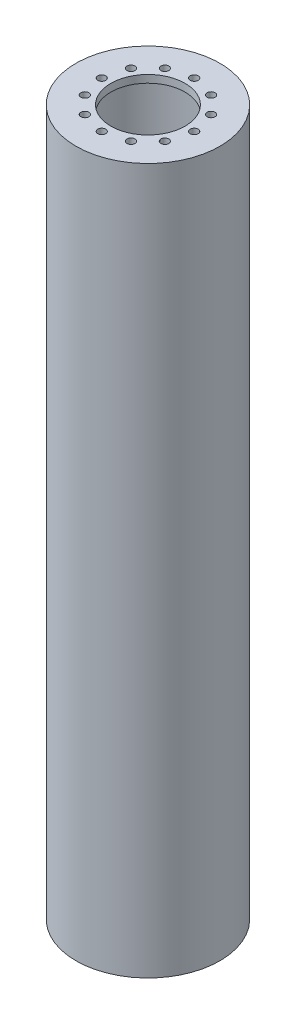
ISO-10303-21;
HEADER;
FILE_DESCRIPTION(('STEP AP214'),'2;1');
FILE_NAME('part.step','',(''),(''),'','','');
FILE_SCHEMA(('AUTOMOTIVE_DESIGN { 1 0 10303 214 1 1 1 1 }'));
ENDSEC;
DATA;
#1=APPLICATION_CONTEXT('core data for automotive mechanical design processes');
#2=APPLICATION_PROTOCOL_DEFINITION('international standard','automotive_design',2000,#1);
#3=PRODUCT_CONTEXT('',#1,'mechanical');
#4=PRODUCT('Part','Part','',(#3));
#5=PRODUCT_RELATED_PRODUCT_CATEGORY('part','',(#4));
#6=PRODUCT_DEFINITION_FORMATION('','',#4);
#7=PRODUCT_DEFINITION_CONTEXT('part definition',#1,'design');
#8=PRODUCT_DEFINITION('design','',#6,#7);
#9=PRODUCT_DEFINITION_SHAPE('','',#8);
#10=(LENGTH_UNIT() NAMED_UNIT(*) SI_UNIT(.MILLI.,.METRE.));
#11=(NAMED_UNIT(*) PLANE_ANGLE_UNIT() SI_UNIT($,.RADIAN.));
#12=(NAMED_UNIT(*) SI_UNIT($,.STERADIAN.) SOLID_ANGLE_UNIT());
#13=UNCERTAINTY_MEASURE_WITH_UNIT(LENGTH_MEASURE(1.E-05),#10,'distance_accuracy_value','');
#14=(GEOMETRIC_REPRESENTATION_CONTEXT(3) GLOBAL_UNCERTAINTY_ASSIGNED_CONTEXT((#13)) GLOBAL_UNIT_ASSIGNED_CONTEXT((#10,
#11,#12)) REPRESENTATION_CONTEXT('',''));
#15=CARTESIAN_POINT('',(0.,0.,0.));
#16=DIRECTION('',(0.,0.,1.));
#17=DIRECTION('',(1.,0.,0.));
#18=AXIS2_PLACEMENT_3D('',#15,#16,#17);
#19=CARTESIAN_POINT('',(0.,-76.1235074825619,0.));
#20=DIRECTION('',(0.,1.,0.));
#21=DIRECTION('',(0.,0.,1.));
#22=AXIS2_PLACEMENT_3D('',#19,#20,#21);
#23=PLANE('',#22);
#24=CARTESIAN_POINT('',(0.,-76.1235074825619,0.));
#25=DIRECTION('',(0.,1.,0.));
#26=DIRECTION('',(0.,0.,1.));
#27=AXIS2_PLACEMENT_3D('',#24,#25,#26);
#28=CIRCLE('',#27,95.0000000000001);
#29=CARTESIAN_POINT('',(0.,-76.1235074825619,95.0000000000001));
#30=VERTEX_POINT('',#29);
#31=EDGE_CURVE('E10',#30,#30,#28,.T.);
#32=ORIENTED_EDGE('',*,*,#31,.F.);
#33=EDGE_LOOP('',(#32));
#34=FACE_BOUND('',#33,.T.);
#35=ADVANCED_FACE('F32',(#34),#23,.F.);
#36=CARTESIAN_POINT('',(0.,1016.28551408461,0.));
#37=DIRECTION('',(0.,1.,0.));
#38=DIRECTION('',(0.,0.,1.));
#39=AXIS2_PLACEMENT_3D('',#36,#37,#38);
#40=CYLINDRICAL_SURFACE('',#39,95.0000000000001);
#41=CARTESIAN_POINT('',(0.,855.076492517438,0.));
#42=DIRECTION('',(0.,1.,0.));
#43=DIRECTION('',(0.,0.,1.));
#44=AXIS2_PLACEMENT_3D('',#41,#42,#43);
#45=CIRCLE('',#44,95.0000000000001);
#46=CARTESIAN_POINT('',(0.,855.076492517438,95.0000000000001));
#47=VERTEX_POINT('',#46);
#48=EDGE_CURVE('E38',#47,#47,#45,.T.);
#49=ORIENTED_EDGE('',*,*,#48,.F.);
#50=EDGE_LOOP('',(#49));
#51=FACE_BOUND('',#50,.T.);
#52=ORIENTED_EDGE('',*,*,#31,.T.);
#53=EDGE_LOOP('',(#52));
#54=FACE_BOUND('',#53,.T.);
#55=ADVANCED_FACE('F136',(#51,#54),#40,.T.);
#56=CARTESIAN_POINT('',(49.,855.076492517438,0.));
#57=DIRECTION('',(0.,-1.,0.));
#58=DIRECTION('',(0.,0.,-1.));
#59=AXIS2_PLACEMENT_3D('',#56,#57,#58);
#60=PLANE('',#59);
#61=CARTESIAN_POINT('',(30.4999999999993,855.076492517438,-52.8275496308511));
#62=DIRECTION('',(0.,1.,0.));
#63=DIRECTION('',(-0.499999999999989,0.,0.866025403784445));
#64=AXIS2_PLACEMENT_3D('',#61,#62,#63);
#65=CIRCLE('',#64,5.25);
#66=CARTESIAN_POINT('',(27.8749999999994,855.076492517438,-48.2809162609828));
#67=VERTEX_POINT('',#66);
#68=EDGE_CURVE('E126',#67,#67,#65,.T.);
#69=ORIENTED_EDGE('',*,*,#68,.F.);
#70=EDGE_LOOP('',(#69));
#71=FACE_BOUND('',#70,.T.);
#72=CARTESIAN_POINT('',(52.8275496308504,855.076492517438,-30.5000000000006));
#73=DIRECTION('',(0.,1.,0.));
#74=DIRECTION('',(-0.866025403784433,0.,0.50000000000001));
#75=AXIS2_PLACEMENT_3D('',#72,#73,#74);
#76=CIRCLE('',#75,5.25);
#77=CARTESIAN_POINT('',(48.2809162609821,855.076492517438,-27.8750000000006));
#78=VERTEX_POINT('',#77);
#79=EDGE_CURVE('E120',#78,#78,#76,.T.);
#80=ORIENTED_EDGE('',*,*,#79,.F.);
#81=EDGE_LOOP('',(#80));
#82=FACE_BOUND('',#81,.T.);
#83=CARTESIAN_POINT('',(61.,855.076492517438,-6.38941085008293E-13));
#84=DIRECTION('',(0.,1.,0.));
#85=DIRECTION('',(-1.,0.,0.));
#86=AXIS2_PLACEMENT_3D('',#83,#84,#85);
#87=CIRCLE('',#86,5.25);
#88=CARTESIAN_POINT('',(55.75,855.076492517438,-5.83950253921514E-13));
#89=VERTEX_POINT('',#88);
#90=EDGE_CURVE('E114',#89,#89,#87,.T.);
#91=ORIENTED_EDGE('',*,*,#90,.F.);
#92=EDGE_LOOP('',(#91));
#93=FACE_BOUND('',#92,.T.);
#94=CARTESIAN_POINT('',(52.827549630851,855.076492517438,30.4999999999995));
#95=DIRECTION('',(0.,1.,0.));
#96=DIRECTION('',(-0.866025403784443,0.,-0.499999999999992));
#97=AXIS2_PLACEMENT_3D('',#94,#95,#96);
#98=CIRCLE('',#97,5.25);
#99=CARTESIAN_POINT('',(48.2809162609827,855.076492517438,27.8749999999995));
#100=VERTEX_POINT('',#99);
#101=EDGE_CURVE('E108',#100,#100,#98,.T.);
#102=ORIENTED_EDGE('',*,*,#101,.F.);
#103=EDGE_LOOP('',(#102));
#104=FACE_BOUND('',#103,.T.);
#105=CARTESIAN_POINT('',(30.5000000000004,855.076492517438,52.8275496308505));
#106=DIRECTION('',(0.,1.,0.));
#107=DIRECTION('',(-0.500000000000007,0.,-0.866025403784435));
#108=AXIS2_PLACEMENT_3D('',#105,#106,#107);
#109=CIRCLE('',#108,5.25);
#110=CARTESIAN_POINT('',(27.8750000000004,855.076492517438,48.2809162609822));
#111=VERTEX_POINT('',#110);
#112=EDGE_CURVE('E102',#111,#111,#109,.T.);
#113=ORIENTED_EDGE('',*,*,#112,.F.);
#114=EDGE_LOOP('',(#113));
#115=FACE_BOUND('',#114,.T.);
#116=CARTESIAN_POINT('',(0.,855.076492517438,61.));
#117=DIRECTION('',(0.,1.,0.));
#118=DIRECTION('',(0.,0.,-1.));
#119=AXIS2_PLACEMENT_3D('',#116,#117,#118);
#120=CIRCLE('',#119,5.25);
#121=CARTESIAN_POINT('',(0.,855.076492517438,55.75));
#122=VERTEX_POINT('',#121);
#123=EDGE_CURVE('E96',#122,#122,#120,.T.);
#124=ORIENTED_EDGE('',*,*,#123,.F.);
#125=EDGE_LOOP('',(#124));
#126=FACE_BOUND('',#125,.T.);
#127=CARTESIAN_POINT('',(-30.4999999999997,855.076492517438,52.8275496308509));
#128=DIRECTION('',(0.,1.,0.));
#129=DIRECTION('',(0.499999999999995,0.,-0.866025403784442));
#130=AXIS2_PLACEMENT_3D('',#127,#128,#129);
#131=CIRCLE('',#130,5.25);
#132=CARTESIAN_POINT('',(-27.8749999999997,855.076492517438,48.2809162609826));
#133=VERTEX_POINT('',#132);
#134=EDGE_CURVE('E90',#133,#133,#131,.T.);
#135=ORIENTED_EDGE('',*,*,#134,.F.);
#136=EDGE_LOOP('',(#135));
#137=FACE_BOUND('',#136,.T.);
#138=CARTESIAN_POINT('',(-52.8275496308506,855.076492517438,30.5000000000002));
#139=DIRECTION('',(0.,1.,0.));
#140=DIRECTION('',(0.866025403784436,0.,-0.500000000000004));
#141=AXIS2_PLACEMENT_3D('',#138,#139,#140);
#142=CIRCLE('',#141,5.25);
#143=CARTESIAN_POINT('',(-52.8275496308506,855.076492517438,35.7500000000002));
#144=VERTEX_POINT('',#143);
#145=EDGE_CURVE('E84',#144,#144,#142,.T.);
#146=ORIENTED_EDGE('',*,*,#145,.F.);
#147=EDGE_LOOP('',(#146));
#148=FACE_BOUND('',#147,.T.);
#149=CARTESIAN_POINT('',(-61.,855.076492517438,2.12980361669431E-13));
#150=DIRECTION('',(0.,1.,0.));
#151=DIRECTION('',(1.,0.,0.));
#152=AXIS2_PLACEMENT_3D('',#149,#150,#151);
#153=CIRCLE('',#152,5.25);
#154=CARTESIAN_POINT('',(-55.75,855.076492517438,1.94650084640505E-13));
#155=VERTEX_POINT('',#154);
#156=EDGE_CURVE('E78',#155,#155,#153,.T.);
#157=ORIENTED_EDGE('',*,*,#156,.F.);
#158=EDGE_LOOP('',(#157));
#159=FACE_BOUND('',#158,.T.);
#160=CARTESIAN_POINT('',(-52.8275496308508,855.076492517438,-30.4999999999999));
#161=DIRECTION('',(0.,1.,0.));
#162=DIRECTION('',(0.86602540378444,0.,0.499999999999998));
#163=AXIS2_PLACEMENT_3D('',#160,#161,#162);
#164=CIRCLE('',#163,5.25);
#165=CARTESIAN_POINT('',(-48.2809162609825,855.076492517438,-27.8749999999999));
#166=VERTEX_POINT('',#165);
#167=EDGE_CURVE('E72',#166,#166,#164,.T.);
#168=ORIENTED_EDGE('',*,*,#167,.F.);
#169=EDGE_LOOP('',(#168));
#170=FACE_BOUND('',#169,.T.);
#171=CARTESIAN_POINT('',(-30.5000000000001,855.076492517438,-52.8275496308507));
#172=DIRECTION('',(0.,1.,0.));
#173=DIRECTION('',(0.500000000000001,0.,0.866025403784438));
#174=AXIS2_PLACEMENT_3D('',#171,#172,#173);
#175=CIRCLE('',#174,5.25);
#176=CARTESIAN_POINT('',(-27.8750000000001,855.076492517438,-48.2809162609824));
#177=VERTEX_POINT('',#176);
#178=EDGE_CURVE('E66',#177,#177,#175,.T.);
#179=ORIENTED_EDGE('',*,*,#178,.F.);
#180=EDGE_LOOP('',(#179));
#181=FACE_BOUND('',#180,.T.);
#182=CARTESIAN_POINT('',(0.,855.076492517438,-61.));
#183=DIRECTION('',(0.,1.,0.));
#184=DIRECTION('',(0.,0.,1.));
#185=AXIS2_PLACEMENT_3D('',#182,#183,#184);
#186=CIRCLE('',#185,5.25);
#187=CARTESIAN_POINT('',(0.,855.076492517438,-55.75));
#188=VERTEX_POINT('',#187);
#189=EDGE_CURVE('E60',#188,#188,#186,.T.);
#190=ORIENTED_EDGE('',*,*,#189,.F.);
#191=EDGE_LOOP('',(#190));
#192=FACE_BOUND('',#191,.T.);
#193=CARTESIAN_POINT('',(0.,855.076492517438,0.));
#194=DIRECTION('',(0.,1.,0.));
#195=DIRECTION('',(0.,0.,1.));
#196=AXIS2_PLACEMENT_3D('',#193,#194,#195);
#197=CIRCLE('',#196,49.);
#198=CARTESIAN_POINT('',(0.,855.076492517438,49.));
#199=VERTEX_POINT('',#198);
#200=EDGE_CURVE('E42',#199,#199,#197,.T.);
#201=ORIENTED_EDGE('',*,*,#200,.F.);
#202=EDGE_LOOP('',(#201));
#203=FACE_BOUND('',#202,.T.);
#204=ORIENTED_EDGE('',*,*,#48,.T.);
#205=EDGE_LOOP('',(#204));
#206=FACE_BOUND('',#205,.T.);
#207=ADVANCED_FACE('F132',(#71,#82,#93,#104,#115,#126,#137,#148,#159,#170,#181,#192,#203,#206),
#60,.F.);
#208=CARTESIAN_POINT('',(0.,1016.28551408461,0.));
#209=DIRECTION('',(0.,1.,0.));
#210=DIRECTION('',(0.,0.,1.));
#211=AXIS2_PLACEMENT_3D('',#208,#209,#210);
#212=CYLINDRICAL_SURFACE('',#211,49.);
#213=CARTESIAN_POINT('',(0.,845.076492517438,0.));
#214=DIRECTION('',(0.,1.,0.));
#215=DIRECTION('',(0.,0.,1.));
#216=AXIS2_PLACEMENT_3D('',#213,#214,#215);
#217=CIRCLE('',#216,49.);
#218=CARTESIAN_POINT('',(0.,845.076492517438,49.));
#219=VERTEX_POINT('',#218);
#220=EDGE_CURVE('E46',#219,#219,#217,.T.);
#221=ORIENTED_EDGE('',*,*,#220,.F.);
#222=EDGE_LOOP('',(#221));
#223=FACE_BOUND('',#222,.T.);
#224=ORIENTED_EDGE('',*,*,#200,.T.);
#225=EDGE_LOOP('',(#224));
#226=FACE_BOUND('',#225,.T.);
#227=ADVANCED_FACE('F135',(#223,#226),#212,.F.);
#228=CARTESIAN_POINT('',(85.0000000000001,845.076492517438,0.));
#229=DIRECTION('',(0.,1.,0.));
#230=DIRECTION('',(0.,0.,1.));
#231=AXIS2_PLACEMENT_3D('',#228,#229,#230);
#232=PLANE('',#231);
#233=CARTESIAN_POINT('',(30.4999999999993,845.076492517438,-52.8275496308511));
#234=DIRECTION('',(0.,1.,0.));
#235=DIRECTION('',(0.,0.,1.));
#236=AXIS2_PLACEMENT_3D('',#233,#234,#235);
#237=CIRCLE('',#236,5.25);
#238=CARTESIAN_POINT('',(30.4999999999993,845.076492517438,-47.5775496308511));
#239=VERTEX_POINT('',#238);
#240=EDGE_CURVE('E123',#239,#239,#237,.F.);
#241=ORIENTED_EDGE('',*,*,#240,.F.);
#242=EDGE_LOOP('',(#241));
#243=FACE_BOUND('',#242,.T.);
#244=CARTESIAN_POINT('',(52.8275496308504,845.076492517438,-30.5000000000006));
#245=DIRECTION('',(0.,1.,0.));
#246=DIRECTION('',(0.,0.,1.));
#247=AXIS2_PLACEMENT_3D('',#244,#245,#246);
#248=CIRCLE('',#247,5.25);
#249=CARTESIAN_POINT('',(52.8275496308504,845.076492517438,-25.2500000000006));
#250=VERTEX_POINT('',#249);
#251=EDGE_CURVE('E117',#250,#250,#248,.F.);
#252=ORIENTED_EDGE('',*,*,#251,.F.);
#253=EDGE_LOOP('',(#252));
#254=FACE_BOUND('',#253,.T.);
#255=CARTESIAN_POINT('',(61.,845.076492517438,-6.38941085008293E-13));
#256=DIRECTION('',(0.,1.,0.));
#257=DIRECTION('',(0.,0.,1.));
#258=AXIS2_PLACEMENT_3D('',#255,#256,#257);
#259=CIRCLE('',#258,5.25);
#260=CARTESIAN_POINT('',(61.,845.076492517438,5.24999999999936));
#261=VERTEX_POINT('',#260);
#262=EDGE_CURVE('E111',#261,#261,#259,.F.);
#263=ORIENTED_EDGE('',*,*,#262,.F.);
#264=EDGE_LOOP('',(#263));
#265=FACE_BOUND('',#264,.T.);
#266=CARTESIAN_POINT('',(52.827549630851,845.076492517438,30.4999999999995));
#267=DIRECTION('',(0.,1.,0.));
#268=DIRECTION('',(0.,0.,1.));
#269=AXIS2_PLACEMENT_3D('',#266,#267,#268);
#270=CIRCLE('',#269,5.25);
#271=CARTESIAN_POINT('',(52.827549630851,845.076492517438,35.7499999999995));
#272=VERTEX_POINT('',#271);
#273=EDGE_CURVE('E105',#272,#272,#270,.F.);
#274=ORIENTED_EDGE('',*,*,#273,.F.);
#275=EDGE_LOOP('',(#274));
#276=FACE_BOUND('',#275,.T.);
#277=CARTESIAN_POINT('',(30.5000000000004,845.076492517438,52.8275496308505));
#278=DIRECTION('',(0.,1.,0.));
#279=DIRECTION('',(0.,0.,1.));
#280=AXIS2_PLACEMENT_3D('',#277,#278,#279);
#281=CIRCLE('',#280,5.25);
#282=CARTESIAN_POINT('',(30.5000000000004,845.076492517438,58.0775496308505));
#283=VERTEX_POINT('',#282);
#284=EDGE_CURVE('E99',#283,#283,#281,.F.);
#285=ORIENTED_EDGE('',*,*,#284,.F.);
#286=EDGE_LOOP('',(#285));
#287=FACE_BOUND('',#286,.T.);
#288=CARTESIAN_POINT('',(0.,845.076492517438,61.));
#289=DIRECTION('',(0.,1.,0.));
#290=DIRECTION('',(0.,0.,1.));
#291=AXIS2_PLACEMENT_3D('',#288,#289,#290);
#292=CIRCLE('',#291,5.25);
#293=CARTESIAN_POINT('',(0.,845.076492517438,66.25));
#294=VERTEX_POINT('',#293);
#295=EDGE_CURVE('E93',#294,#294,#292,.F.);
#296=ORIENTED_EDGE('',*,*,#295,.F.);
#297=EDGE_LOOP('',(#296));
#298=FACE_BOUND('',#297,.T.);
#299=CARTESIAN_POINT('',(-30.4999999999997,845.076492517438,52.8275496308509));
#300=DIRECTION('',(0.,1.,0.));
#301=DIRECTION('',(0.,0.,1.));
#302=AXIS2_PLACEMENT_3D('',#299,#300,#301);
#303=CIRCLE('',#302,5.25);
#304=CARTESIAN_POINT('',(-30.4999999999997,845.076492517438,58.0775496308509));
#305=VERTEX_POINT('',#304);
#306=EDGE_CURVE('E87',#305,#305,#303,.F.);
#307=ORIENTED_EDGE('',*,*,#306,.F.);
#308=EDGE_LOOP('',(#307));
#309=FACE_BOUND('',#308,.T.);
#310=CARTESIAN_POINT('',(-52.8275496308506,845.076492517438,30.5000000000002));
#311=DIRECTION('',(0.,1.,0.));
#312=DIRECTION('',(0.,0.,1.));
#313=AXIS2_PLACEMENT_3D('',#310,#311,#312);
#314=CIRCLE('',#313,5.25);
#315=CARTESIAN_POINT('',(-52.8275496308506,845.076492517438,35.7500000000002));
#316=VERTEX_POINT('',#315);
#317=EDGE_CURVE('E81',#316,#316,#314,.F.);
#318=ORIENTED_EDGE('',*,*,#317,.F.);
#319=EDGE_LOOP('',(#318));
#320=FACE_BOUND('',#319,.T.);
#321=CARTESIAN_POINT('',(-61.,845.076492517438,2.12980361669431E-13));
#322=DIRECTION('',(0.,1.,0.));
#323=DIRECTION('',(0.,0.,1.));
#324=AXIS2_PLACEMENT_3D('',#321,#322,#323);
#325=CIRCLE('',#324,5.25);
#326=CARTESIAN_POINT('',(-61.,845.076492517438,5.25000000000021));
#327=VERTEX_POINT('',#326);
#328=EDGE_CURVE('E75',#327,#327,#325,.F.);
#329=ORIENTED_EDGE('',*,*,#328,.F.);
#330=EDGE_LOOP('',(#329));
#331=FACE_BOUND('',#330,.T.);
#332=CARTESIAN_POINT('',(-52.8275496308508,845.076492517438,-30.4999999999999));
#333=DIRECTION('',(0.,1.,0.));
#334=DIRECTION('',(0.,0.,1.));
#335=AXIS2_PLACEMENT_3D('',#332,#333,#334);
#336=CIRCLE('',#335,5.25);
#337=CARTESIAN_POINT('',(-52.8275496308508,845.076492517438,-25.2499999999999));
#338=VERTEX_POINT('',#337);
#339=EDGE_CURVE('E69',#338,#338,#336,.F.);
#340=ORIENTED_EDGE('',*,*,#339,.F.);
#341=EDGE_LOOP('',(#340));
#342=FACE_BOUND('',#341,.T.);
#343=CARTESIAN_POINT('',(-30.5000000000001,845.076492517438,-52.8275496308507));
#344=DIRECTION('',(0.,1.,0.));
#345=DIRECTION('',(0.,0.,1.));
#346=AXIS2_PLACEMENT_3D('',#343,#344,#345);
#347=CIRCLE('',#346,5.25);
#348=CARTESIAN_POINT('',(-30.5000000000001,845.076492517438,-47.5775496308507));
#349=VERTEX_POINT('',#348);
#350=EDGE_CURVE('E63',#349,#349,#347,.F.);
#351=ORIENTED_EDGE('',*,*,#350,.F.);
#352=EDGE_LOOP('',(#351));
#353=FACE_BOUND('',#352,.T.);
#354=CARTESIAN_POINT('',(0.,845.076492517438,-61.));
#355=DIRECTION('',(0.,1.,0.));
#356=DIRECTION('',(0.,0.,1.));
#357=AXIS2_PLACEMENT_3D('',#354,#355,#356);
#358=CIRCLE('',#357,5.25);
#359=CARTESIAN_POINT('',(0.,845.076492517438,-55.75));
#360=VERTEX_POINT('',#359);
#361=EDGE_CURVE('E57',#360,#360,#358,.F.);
#362=ORIENTED_EDGE('',*,*,#361,.F.);
#363=EDGE_LOOP('',(#362));
#364=FACE_BOUND('',#363,.T.);
#365=CARTESIAN_POINT('',(0.,845.076492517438,0.));
#366=DIRECTION('',(0.,1.,0.));
#367=DIRECTION('',(0.,0.,1.));
#368=AXIS2_PLACEMENT_3D('',#365,#366,#367);
#369=CIRCLE('',#368,85.0000000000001);
#370=CARTESIAN_POINT('',(0.,845.076492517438,85.0000000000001));
#371=VERTEX_POINT('',#370);
#372=EDGE_CURVE('E51',#371,#371,#369,.T.);
#373=ORIENTED_EDGE('',*,*,#372,.F.);
#374=EDGE_LOOP('',(#373));
#375=FACE_BOUND('',#374,.T.);
#376=ORIENTED_EDGE('',*,*,#220,.T.);
#377=EDGE_LOOP('',(#376));
#378=FACE_BOUND('',#377,.T.);
#379=ADVANCED_FACE('F163',(#243,#254,#265,#276,#287,#298,#309,#320,#331,#342,#353,#364,#375,
#378),#232,.F.);
#380=CARTESIAN_POINT('',(0.,1016.28551408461,0.));
#381=DIRECTION('',(0.,1.,0.));
#382=DIRECTION('',(0.,0.,1.));
#383=AXIS2_PLACEMENT_3D('',#380,#381,#382);
#384=CYLINDRICAL_SURFACE('',#383,85.0000000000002);
#385=CARTESIAN_POINT('',(0.,-66.1235074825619,0.));
#386=DIRECTION('',(0.,1.,0.));
#387=DIRECTION('',(0.,0.,1.));
#388=AXIS2_PLACEMENT_3D('',#385,#386,#387);
#389=CIRCLE('',#388,85.0000000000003);
#390=CARTESIAN_POINT('',(0.,-66.1235074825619,85.0000000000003));
#391=VERTEX_POINT('',#390);
#392=EDGE_CURVE('E54',#391,#391,#389,.T.);
#393=ORIENTED_EDGE('',*,*,#392,.F.);
#394=EDGE_LOOP('',(#393));
#395=FACE_BOUND('',#394,.T.);
#396=ORIENTED_EDGE('',*,*,#372,.T.);
#397=EDGE_LOOP('',(#396));
#398=FACE_BOUND('',#397,.T.);
#399=ADVANCED_FACE('F169',(#395,#398),#384,.F.);
#400=CARTESIAN_POINT('',(85.0000000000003,-66.1235074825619,0.));
#401=DIRECTION('',(0.,-1.,0.));
#402=DIRECTION('',(0.,0.,-1.));
#403=AXIS2_PLACEMENT_3D('',#400,#401,#402);
#404=PLANE('',#403);
#405=ORIENTED_EDGE('',*,*,#392,.T.);
#406=EDGE_LOOP('',(#405));
#407=FACE_BOUND('',#406,.T.);
#408=ADVANCED_FACE('F315',(#407),#404,.F.);
#409=CARTESIAN_POINT('',(0.,830.227250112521,-61.));
#410=DIRECTION('',(0.,1.,0.));
#411=DIRECTION('',(0.,0.,1.));
#412=AXIS2_PLACEMENT_3D('',#409,#410,#411);
#413=CYLINDRICAL_SURFACE('',#412,5.25);
#414=ORIENTED_EDGE('',*,*,#361,.T.);
#415=EDGE_LOOP('',(#414));
#416=FACE_BOUND('',#415,.T.);
#417=ORIENTED_EDGE('',*,*,#189,.T.);
#418=EDGE_LOOP('',(#417));
#419=FACE_BOUND('',#418,.T.);
#420=ADVANCED_FACE('F192',(#416,#419),#413,.F.);
#421=CARTESIAN_POINT('',(-30.5000000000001,830.227250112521,-52.8275496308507));
#422=DIRECTION('',(0.,1.,0.));
#423=DIRECTION('',(0.,0.,1.));
#424=AXIS2_PLACEMENT_3D('',#421,#422,#423);
#425=CYLINDRICAL_SURFACE('',#424,5.25);
#426=ORIENTED_EDGE('',*,*,#350,.T.);
#427=EDGE_LOOP('',(#426));
#428=FACE_BOUND('',#427,.T.);
#429=ORIENTED_EDGE('',*,*,#178,.T.);
#430=EDGE_LOOP('',(#429));
#431=FACE_BOUND('',#430,.T.);
#432=ADVANCED_FACE('F205',(#428,#431),#425,.F.);
#433=CARTESIAN_POINT('',(-52.8275496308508,830.227250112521,-30.4999999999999));
#434=DIRECTION('',(0.,1.,0.));
#435=DIRECTION('',(0.,0.,1.));
#436=AXIS2_PLACEMENT_3D('',#433,#434,#435);
#437=CYLINDRICAL_SURFACE('',#436,5.25);
#438=ORIENTED_EDGE('',*,*,#339,.T.);
#439=EDGE_LOOP('',(#438));
#440=FACE_BOUND('',#439,.T.);
#441=ORIENTED_EDGE('',*,*,#167,.T.);
#442=EDGE_LOOP('',(#441));
#443=FACE_BOUND('',#442,.T.);
#444=ADVANCED_FACE('F210',(#440,#443),#437,.F.);
#445=CARTESIAN_POINT('',(-61.,830.227250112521,2.12980361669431E-13));
#446=DIRECTION('',(0.,1.,0.));
#447=DIRECTION('',(0.,0.,1.));
#448=AXIS2_PLACEMENT_3D('',#445,#446,#447);
#449=CYLINDRICAL_SURFACE('',#448,5.25);
#450=ORIENTED_EDGE('',*,*,#328,.T.);
#451=EDGE_LOOP('',(#450));
#452=FACE_BOUND('',#451,.T.);
#453=ORIENTED_EDGE('',*,*,#156,.T.);
#454=EDGE_LOOP('',(#453));
#455=FACE_BOUND('',#454,.T.);
#456=ADVANCED_FACE('F220',(#452,#455),#449,.F.);
#457=CARTESIAN_POINT('',(-52.8275496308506,830.227250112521,30.5000000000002));
#458=DIRECTION('',(0.,1.,0.));
#459=DIRECTION('',(0.,0.,1.));
#460=AXIS2_PLACEMENT_3D('',#457,#458,#459);
#461=CYLINDRICAL_SURFACE('',#460,5.25);
#462=CARTESIAN_POINT('',(-52.8275496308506,845.076492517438,35.7500000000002));
#463=CARTESIAN_POINT('',(-52.8275496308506,845.180659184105,35.7500000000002));
#464=CARTESIAN_POINT('',(-52.8275496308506,845.284825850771,35.7500000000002));
#465=CARTESIAN_POINT('',(-52.8275496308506,845.493159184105,35.7500000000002));
#466=CARTESIAN_POINT('',(-52.8275496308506,845.597325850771,35.7500000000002));
#467=CARTESIAN_POINT('',(-52.8275496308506,845.805659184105,35.7500000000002));
#468=CARTESIAN_POINT('',(-52.8275496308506,845.909825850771,35.7500000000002));
#469=CARTESIAN_POINT('',(-52.8275496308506,846.118159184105,35.7500000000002));
#470=CARTESIAN_POINT('',(-52.8275496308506,846.222325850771,35.7500000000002));
#471=CARTESIAN_POINT('',(-52.8275496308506,846.430659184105,35.7500000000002));
#472=CARTESIAN_POINT('',(-52.8275496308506,846.534825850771,35.7500000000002));
#473=CARTESIAN_POINT('',(-52.8275496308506,846.743159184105,35.7500000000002));
#474=CARTESIAN_POINT('',(-52.8275496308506,846.847325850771,35.7500000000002));
#475=CARTESIAN_POINT('',(-52.8275496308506,847.055659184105,35.7500000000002));
#476=CARTESIAN_POINT('',(-52.8275496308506,847.159825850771,35.7500000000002));
#477=CARTESIAN_POINT('',(-52.8275496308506,847.368159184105,35.7500000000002));
#478=CARTESIAN_POINT('',(-52.8275496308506,847.472325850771,35.7500000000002));
#479=CARTESIAN_POINT('',(-52.8275496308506,847.680659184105,35.7500000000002));
#480=CARTESIAN_POINT('',(-52.8275496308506,847.784825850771,35.7500000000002));
#481=CARTESIAN_POINT('',(-52.8275496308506,847.993159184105,35.7500000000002));
#482=CARTESIAN_POINT('',(-52.8275496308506,848.097325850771,35.7500000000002));
#483=CARTESIAN_POINT('',(-52.8275496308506,848.305659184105,35.7500000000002));
#484=CARTESIAN_POINT('',(-52.8275496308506,848.409825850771,35.7500000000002));
#485=CARTESIAN_POINT('',(-52.8275496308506,848.618159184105,35.7500000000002));
#486=CARTESIAN_POINT('',(-52.8275496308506,848.722325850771,35.7500000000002));
#487=CARTESIAN_POINT('',(-52.8275496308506,848.930659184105,35.7500000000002));
#488=CARTESIAN_POINT('',(-52.8275496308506,849.034825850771,35.7500000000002));
#489=CARTESIAN_POINT('',(-52.8275496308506,849.243159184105,35.7500000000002));
#490=CARTESIAN_POINT('',(-52.8275496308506,849.347325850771,35.7500000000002));
#491=CARTESIAN_POINT('',(-52.8275496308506,849.555659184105,35.7500000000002));
#492=CARTESIAN_POINT('',(-52.8275496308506,849.659825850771,35.7500000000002));
#493=CARTESIAN_POINT('',(-52.8275496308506,849.868159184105,35.7500000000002));
#494=CARTESIAN_POINT('',(-52.8275496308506,849.972325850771,35.7500000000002));
#495=CARTESIAN_POINT('',(-52.8275496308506,850.180659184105,35.7500000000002));
#496=CARTESIAN_POINT('',(-52.8275496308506,850.284825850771,35.7500000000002));
#497=CARTESIAN_POINT('',(-52.8275496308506,850.493159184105,35.7500000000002));
#498=CARTESIAN_POINT('',(-52.8275496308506,850.597325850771,35.7500000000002));
#499=CARTESIAN_POINT('',(-52.8275496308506,850.805659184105,35.7500000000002));
#500=CARTESIAN_POINT('',(-52.8275496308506,850.909825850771,35.7500000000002));
#501=CARTESIAN_POINT('',(-52.8275496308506,851.118159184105,35.7500000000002));
#502=CARTESIAN_POINT('',(-52.8275496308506,851.222325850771,35.7500000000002));
#503=CARTESIAN_POINT('',(-52.8275496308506,851.430659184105,35.7500000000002));
#504=CARTESIAN_POINT('',(-52.8275496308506,851.534825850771,35.7500000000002));
#505=CARTESIAN_POINT('',(-52.8275496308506,851.743159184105,35.7500000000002));
#506=CARTESIAN_POINT('',(-52.8275496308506,851.847325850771,35.7500000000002));
#507=CARTESIAN_POINT('',(-52.8275496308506,852.055659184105,35.7500000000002));
#508=CARTESIAN_POINT('',(-52.8275496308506,852.159825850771,35.7500000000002));
#509=CARTESIAN_POINT('',(-52.8275496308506,852.368159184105,35.7500000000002));
#510=CARTESIAN_POINT('',(-52.8275496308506,852.472325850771,35.7500000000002));
#511=CARTESIAN_POINT('',(-52.8275496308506,852.680659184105,35.7500000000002));
#512=CARTESIAN_POINT('',(-52.8275496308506,852.784825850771,35.7500000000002));
#513=CARTESIAN_POINT('',(-52.8275496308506,852.993159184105,35.7500000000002));
#514=CARTESIAN_POINT('',(-52.8275496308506,853.097325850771,35.7500000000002));
#515=CARTESIAN_POINT('',(-52.8275496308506,853.305659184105,35.7500000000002));
#516=CARTESIAN_POINT('',(-52.8275496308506,853.409825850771,35.7500000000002));
#517=CARTESIAN_POINT('',(-52.8275496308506,853.618159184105,35.7500000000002));
#518=CARTESIAN_POINT('',(-52.8275496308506,853.722325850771,35.7500000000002));
#519=CARTESIAN_POINT('',(-52.8275496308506,853.930659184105,35.7500000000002));
#520=CARTESIAN_POINT('',(-52.8275496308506,854.034825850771,35.7500000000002));
#521=CARTESIAN_POINT('',(-52.8275496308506,854.243159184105,35.7500000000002));
#522=CARTESIAN_POINT('',(-52.8275496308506,854.347325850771,35.7500000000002));
#523=CARTESIAN_POINT('',(-52.8275496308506,854.555659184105,35.7500000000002));
#524=CARTESIAN_POINT('',(-52.8275496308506,854.659825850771,35.7500000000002));
#525=CARTESIAN_POINT('',(-52.8275496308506,854.868159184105,35.7500000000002));
#526=CARTESIAN_POINT('',(-52.8275496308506,854.972325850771,35.7500000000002));
#527=CARTESIAN_POINT('',(-52.8275496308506,855.076492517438,35.7500000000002));
#528=B_SPLINE_CURVE_WITH_KNOTS('',3,(#462,#463,#464,#465,#466,#467,#468,#469,#470,#471,#472,
#473,#474,#475,#476,#477,#478,#479,#480,#481,#482,#483,#484,#485,#486,#487,#488,#489,#490,#491,
#492,#493,#494,#495,#496,#497,#498,#499,#500,#501,#502,#503,#504,#505,#506,#507,#508,#509,#510,
#511,#512,#513,#514,#515,#516,#517,#518,#519,#520,#521,#522,#523,#524,#525,#526,#527),
.UNSPECIFIED.,.F.,.F.,(4,2,2,2,2,2,2,2,2,2,2,2,2,2,2,2,2,2,2,2,2,2,2,2,2,2,2,2,2,2,2,2,4),(0.,
0.312500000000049,0.625000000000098,0.937500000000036,1.25000000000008,1.56250000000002,
1.87500000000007,2.18750000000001,2.50000000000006,2.81250000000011,3.12500000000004,
3.43750000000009,3.75000000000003,4.06250000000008,4.37500000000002,4.68750000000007,5.,
5.31250000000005,5.6250000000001,5.93750000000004,6.25000000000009,6.56250000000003,
6.87500000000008,7.18750000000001,7.50000000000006,7.81250000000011,8.12500000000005,
8.4375000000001,8.75000000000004,9.06250000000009,9.37500000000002,9.68750000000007,10.),.UNSPECIFIED.);
#529=EDGE_CURVE('BSEAM230',#316,#144,#528,.T.);
#530=ORIENTED_EDGE('',*,*,#317,.T.);
#531=ORIENTED_EDGE('',*,*,#145,.T.);
#532=ORIENTED_EDGE('',*,*,#529,.T.);
#533=ORIENTED_EDGE('',*,*,#529,.F.);
#534=EDGE_LOOP('',(#530,#532,#531,#533));
#535=FACE_BOUND('',#534,.T.);
#536=ADVANCED_FACE('F230',(#535),#461,.F.);
#537=CARTESIAN_POINT('',(-30.4999999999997,830.227250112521,52.8275496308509));
#538=DIRECTION('',(0.,1.,0.));
#539=DIRECTION('',(0.,0.,1.));
#540=AXIS2_PLACEMENT_3D('',#537,#538,#539);
#541=CYLINDRICAL_SURFACE('',#540,5.25);
#542=ORIENTED_EDGE('',*,*,#306,.T.);
#543=EDGE_LOOP('',(#542));
#544=FACE_BOUND('',#543,.T.);
#545=ORIENTED_EDGE('',*,*,#134,.T.);
#546=EDGE_LOOP('',(#545));
#547=FACE_BOUND('',#546,.T.);
#548=ADVANCED_FACE('F240',(#544,#547),#541,.F.);
#549=CARTESIAN_POINT('',(0.,830.227250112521,61.));
#550=DIRECTION('',(0.,1.,0.));
#551=DIRECTION('',(0.,0.,1.));
#552=AXIS2_PLACEMENT_3D('',#549,#550,#551);
#553=CYLINDRICAL_SURFACE('',#552,5.25);
#554=ORIENTED_EDGE('',*,*,#295,.T.);
#555=EDGE_LOOP('',(#554));
#556=FACE_BOUND('',#555,.T.);
#557=ORIENTED_EDGE('',*,*,#123,.T.);
#558=EDGE_LOOP('',(#557));
#559=FACE_BOUND('',#558,.T.);
#560=ADVANCED_FACE('F250',(#556,#559),#553,.F.);
#561=CARTESIAN_POINT('',(30.5000000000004,830.227250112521,52.8275496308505));
#562=DIRECTION('',(0.,1.,0.));
#563=DIRECTION('',(0.,0.,1.));
#564=AXIS2_PLACEMENT_3D('',#561,#562,#563);
#565=CYLINDRICAL_SURFACE('',#564,5.25);
#566=ORIENTED_EDGE('',*,*,#284,.T.);
#567=EDGE_LOOP('',(#566));
#568=FACE_BOUND('',#567,.T.);
#569=ORIENTED_EDGE('',*,*,#112,.T.);
#570=EDGE_LOOP('',(#569));
#571=FACE_BOUND('',#570,.T.);
#572=ADVANCED_FACE('F260',(#568,#571),#565,.F.);
#573=CARTESIAN_POINT('',(52.827549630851,830.227250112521,30.4999999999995));
#574=DIRECTION('',(0.,1.,0.));
#575=DIRECTION('',(0.,0.,1.));
#576=AXIS2_PLACEMENT_3D('',#573,#574,#575);
#577=CYLINDRICAL_SURFACE('',#576,5.25);
#578=ORIENTED_EDGE('',*,*,#273,.T.);
#579=EDGE_LOOP('',(#578));
#580=FACE_BOUND('',#579,.T.);
#581=ORIENTED_EDGE('',*,*,#101,.T.);
#582=EDGE_LOOP('',(#581));
#583=FACE_BOUND('',#582,.T.);
#584=ADVANCED_FACE('F270',(#580,#583),#577,.F.);
#585=CARTESIAN_POINT('',(61.,830.227250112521,-6.38941085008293E-13));
#586=DIRECTION('',(0.,1.,0.));
#587=DIRECTION('',(0.,0.,1.));
#588=AXIS2_PLACEMENT_3D('',#585,#586,#587);
#589=CYLINDRICAL_SURFACE('',#588,5.25);
#590=ORIENTED_EDGE('',*,*,#262,.T.);
#591=EDGE_LOOP('',(#590));
#592=FACE_BOUND('',#591,.T.);
#593=ORIENTED_EDGE('',*,*,#90,.T.);
#594=EDGE_LOOP('',(#593));
#595=FACE_BOUND('',#594,.T.);
#596=ADVANCED_FACE('F280',(#592,#595),#589,.F.);
#597=CARTESIAN_POINT('',(52.8275496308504,830.227250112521,-30.5000000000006));
#598=DIRECTION('',(0.,1.,0.));
#599=DIRECTION('',(0.,0.,1.));
#600=AXIS2_PLACEMENT_3D('',#597,#598,#599);
#601=CYLINDRICAL_SURFACE('',#600,5.25);
#602=ORIENTED_EDGE('',*,*,#251,.T.);
#603=EDGE_LOOP('',(#602));
#604=FACE_BOUND('',#603,.T.);
#605=ORIENTED_EDGE('',*,*,#79,.T.);
#606=EDGE_LOOP('',(#605));
#607=FACE_BOUND('',#606,.T.);
#608=ADVANCED_FACE('F290',(#604,#607),#601,.F.);
#609=CARTESIAN_POINT('',(30.4999999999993,830.227250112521,-52.8275496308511));
#610=DIRECTION('',(0.,1.,0.));
#611=DIRECTION('',(0.,0.,1.));
#612=AXIS2_PLACEMENT_3D('',#609,#610,#611);
#613=CYLINDRICAL_SURFACE('',#612,5.25);
#614=ORIENTED_EDGE('',*,*,#240,.T.);
#615=EDGE_LOOP('',(#614));
#616=FACE_BOUND('',#615,.T.);
#617=ORIENTED_EDGE('',*,*,#68,.T.);
#618=EDGE_LOOP('',(#617));
#619=FACE_BOUND('',#618,.T.);
#620=ADVANCED_FACE('F130',(#616,#619),#613,.F.);
#621=CLOSED_SHELL('',(#35,#55,#207,#227,#379,#399,#408,#420,#432,#444,#456,#536,#548,#560,#572,
#584,#596,#608,#620));
#622=MANIFOLD_SOLID_BREP('B2',#621);
#623=ADVANCED_BREP_SHAPE_REPRESENTATION('',(#18,#622),#14);
#624=SHAPE_DEFINITION_REPRESENTATION(#9,#623);
ENDSEC;
END-ISO-10303-21;
